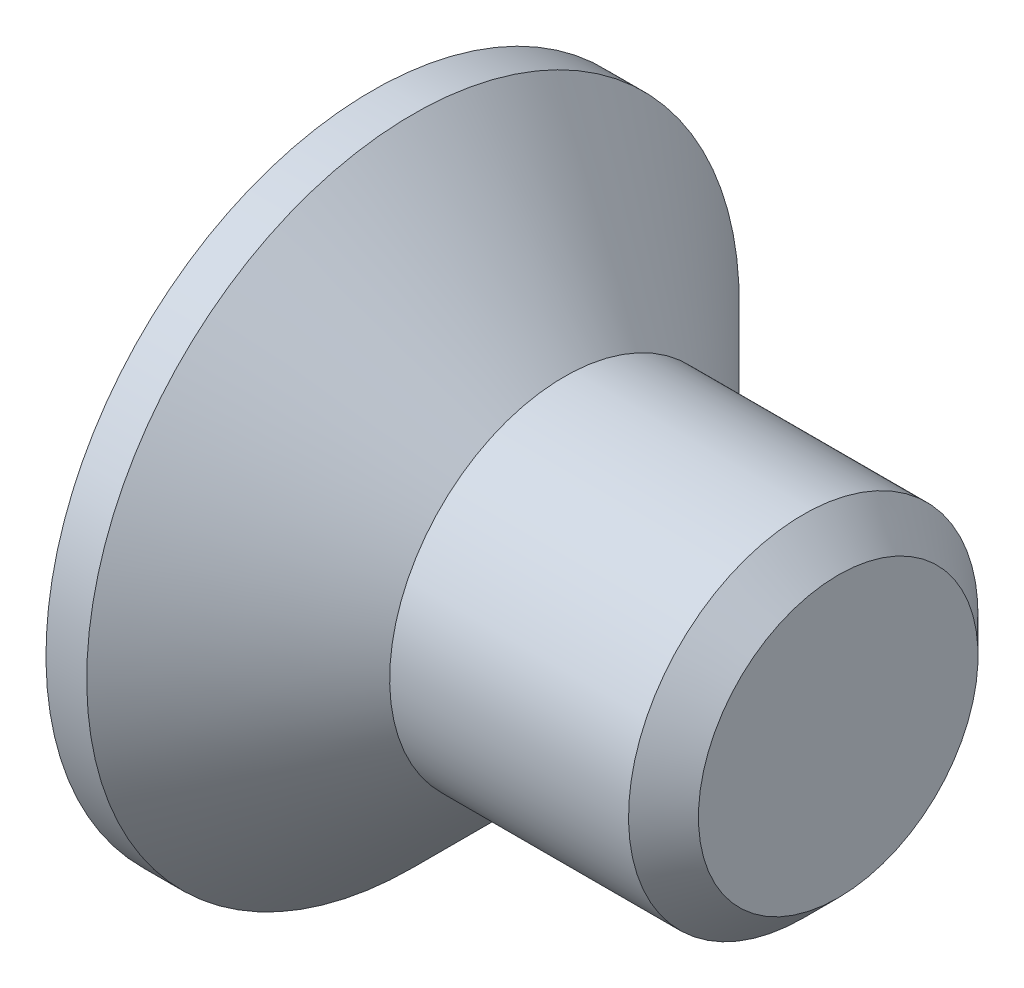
ISO-10303-21;
HEADER;
FILE_DESCRIPTION(('STEP AP214'),'2;1');
FILE_NAME('part.step','',(''),(''),'','','');
FILE_SCHEMA(('AUTOMOTIVE_DESIGN { 1 0 10303 214 1 1 1 1 }'));
ENDSEC;
DATA;
#1=APPLICATION_CONTEXT('core data for automotive mechanical design processes');
#2=APPLICATION_PROTOCOL_DEFINITION('international standard','automotive_design',2000,#1);
#3=PRODUCT_CONTEXT('',#1,'mechanical');
#4=PRODUCT('Part','Part','',(#3));
#5=PRODUCT_RELATED_PRODUCT_CATEGORY('part','',(#4));
#6=PRODUCT_DEFINITION_FORMATION('','',#4);
#7=PRODUCT_DEFINITION_CONTEXT('part definition',#1,'design');
#8=PRODUCT_DEFINITION('design','',#6,#7);
#9=PRODUCT_DEFINITION_SHAPE('','',#8);
#10=(LENGTH_UNIT() NAMED_UNIT(*) SI_UNIT(.MILLI.,.METRE.));
#11=(NAMED_UNIT(*) PLANE_ANGLE_UNIT() SI_UNIT($,.RADIAN.));
#12=(NAMED_UNIT(*) SI_UNIT($,.STERADIAN.) SOLID_ANGLE_UNIT());
#13=UNCERTAINTY_MEASURE_WITH_UNIT(LENGTH_MEASURE(1.E-05),#10,'distance_accuracy_value','');
#14=(GEOMETRIC_REPRESENTATION_CONTEXT(3) GLOBAL_UNCERTAINTY_ASSIGNED_CONTEXT((#13)) GLOBAL_UNIT_ASSIGNED_CONTEXT((#10,
#11,#12)) REPRESENTATION_CONTEXT('',''));
#15=CARTESIAN_POINT('',(0.,0.,0.));
#16=DIRECTION('',(0.,0.,1.));
#17=DIRECTION('',(1.,0.,0.));
#18=AXIS2_PLACEMENT_3D('',#15,#16,#17);
#19=CARTESIAN_POINT('',(0.,0.,0.));
#20=DIRECTION('',(-1.,0.,0.));
#21=DIRECTION('',(0.,-1.,0.));
#22=AXIS2_PLACEMENT_3D('',#19,#20,#21);
#23=CONICAL_SURFACE('',#22,1.5,0.78539816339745);
#24=CARTESIAN_POINT('',(-1.3,0.,0.));
#25=DIRECTION('',(-1.,0.,0.));
#26=DIRECTION('',(0.,-1.,0.));
#27=AXIS2_PLACEMENT_3D('',#24,#25,#26);
#28=CIRCLE('',#27,2.8);
#29=CARTESIAN_POINT('',(-1.3,-2.8,0.));
#30=VERTEX_POINT('',#29);
#31=EDGE_CURVE('E189',#30,#30,#28,.T.);
#32=ORIENTED_EDGE('',*,*,#31,.F.);
#33=EDGE_LOOP('',(#32));
#34=FACE_BOUND('',#33,.T.);
#35=CARTESIAN_POINT('',(0.,0.,0.));
#36=DIRECTION('',(-1.,0.,0.));
#37=DIRECTION('',(0.,-1.,0.));
#38=AXIS2_PLACEMENT_3D('',#35,#36,#37);
#39=CIRCLE('',#38,1.5);
#40=CARTESIAN_POINT('',(0.,-1.5,0.));
#41=VERTEX_POINT('',#40);
#42=EDGE_CURVE('E212',#41,#41,#39,.T.);
#43=ORIENTED_EDGE('',*,*,#42,.T.);
#44=EDGE_LOOP('',(#43));
#45=FACE_BOUND('',#44,.T.);
#46=ADVANCED_FACE('F33',(#34,#45),#23,.T.);
#47=CARTESIAN_POINT('',(-1.65,0.,0.));
#48=DIRECTION('',(-1.,0.,0.));
#49=DIRECTION('',(0.,-1.,0.));
#50=AXIS2_PLACEMENT_3D('',#47,#48,#49);
#51=CYLINDRICAL_SURFACE('',#50,1.5);
#52=CARTESIAN_POINT('',(2.05,0.,0.));
#53=DIRECTION('',(-1.,0.,0.));
#54=DIRECTION('',(0.,-1.,0.));
#55=AXIS2_PLACEMENT_3D('',#52,#53,#54);
#56=CIRCLE('',#55,1.5);
#57=CARTESIAN_POINT('',(2.05,-1.5,0.));
#58=VERTEX_POINT('',#57);
#59=EDGE_CURVE('E41',#58,#58,#56,.T.);
#60=ORIENTED_EDGE('',*,*,#59,.T.);
#61=EDGE_LOOP('',(#60));
#62=FACE_BOUND('',#61,.T.);
#63=ORIENTED_EDGE('',*,*,#42,.F.);
#64=EDGE_LOOP('',(#63));
#65=FACE_BOUND('',#64,.T.);
#66=ADVANCED_FACE('F217',(#62,#65),#51,.T.);
#67=CARTESIAN_POINT('',(2.35,0.,0.));
#68=DIRECTION('',(-1.,0.,0.));
#69=DIRECTION('',(0.,-1.,0.));
#70=AXIS2_PLACEMENT_3D('',#67,#68,#69);
#71=PLANE('',#70);
#72=CARTESIAN_POINT('',(2.35,0.,0.));
#73=DIRECTION('',(-1.,0.,0.));
#74=DIRECTION('',(0.,-1.,0.));
#75=AXIS2_PLACEMENT_3D('',#72,#73,#74);
#76=CIRCLE('',#75,1.2);
#77=CARTESIAN_POINT('',(2.35,-1.2,0.));
#78=VERTEX_POINT('',#77);
#79=EDGE_CURVE('E11',#78,#78,#76,.F.);
#80=ORIENTED_EDGE('',*,*,#79,.T.);
#81=EDGE_LOOP('',(#80));
#82=FACE_BOUND('',#81,.T.);
#83=ADVANCED_FACE('F239',(#82),#71,.F.);
#84=CARTESIAN_POINT('',(-1.65,2.8,0.));
#85=DIRECTION('',(1.,0.,0.));
#86=DIRECTION('',(0.,1.,0.));
#87=AXIS2_PLACEMENT_3D('',#84,#85,#86);
#88=PLANE('',#87);
#89=DIRECTION('',(0.,0.,-1.));
#90=VECTOR('',#89,1.);
#91=CARTESIAN_POINT('',(-1.65,0.365,-1.45));
#92=LINE('',#91,#90);
#93=CARTESIAN_POINT('',(-1.65,0.365,-0.365));
#94=VERTEX_POINT('',#93);
#95=CARTESIAN_POINT('',(-1.65,0.365,-1.45));
#96=VERTEX_POINT('',#95);
#97=EDGE_CURVE('E158',#94,#96,#92,.T.);
#98=ORIENTED_EDGE('',*,*,#97,.F.);
#99=DIRECTION('',(0.,-1.,0.));
#100=VECTOR('',#99,1.);
#101=CARTESIAN_POINT('',(-1.65,0.365,-0.365));
#102=LINE('',#101,#100);
#103=CARTESIAN_POINT('',(-1.65,1.45,-0.365));
#104=VERTEX_POINT('',#103);
#105=EDGE_CURVE('E48',#104,#94,#102,.T.);
#106=ORIENTED_EDGE('',*,*,#105,.F.);
#107=DIRECTION('',(0.,0.,-1.));
#108=VECTOR('',#107,1.);
#109=CARTESIAN_POINT('',(-1.65,1.45,-0.365));
#110=LINE('',#109,#108);
#111=CARTESIAN_POINT('',(-1.65,1.45,0.365));
#112=VERTEX_POINT('',#111);
#113=EDGE_CURVE('E185',#112,#104,#110,.T.);
#114=ORIENTED_EDGE('',*,*,#113,.F.);
#115=DIRECTION('',(0.,1.,0.));
#116=VECTOR('',#115,1.);
#117=CARTESIAN_POINT('',(-1.65,1.45,0.365));
#118=LINE('',#117,#116);
#119=CARTESIAN_POINT('',(-1.65,0.365,0.365));
#120=VERTEX_POINT('',#119);
#121=EDGE_CURVE('E183',#120,#112,#118,.T.);
#122=ORIENTED_EDGE('',*,*,#121,.F.);
#123=DIRECTION('',(0.,0.,-1.));
#124=VECTOR('',#123,1.);
#125=CARTESIAN_POINT('',(-1.65,0.365,0.365));
#126=LINE('',#125,#124);
#127=CARTESIAN_POINT('',(-1.65,0.365,1.45));
#128=VERTEX_POINT('',#127);
#129=EDGE_CURVE('E132',#128,#120,#126,.T.);
#130=ORIENTED_EDGE('',*,*,#129,.F.);
#131=DIRECTION('',(0.,1.,0.));
#132=VECTOR('',#131,1.);
#133=CARTESIAN_POINT('',(-1.65,0.365,1.45));
#134=LINE('',#133,#132);
#135=CARTESIAN_POINT('',(-1.65,-0.365,1.45));
#136=VERTEX_POINT('',#135);
#137=EDGE_CURVE('E179',#136,#128,#134,.T.);
#138=ORIENTED_EDGE('',*,*,#137,.F.);
#139=DIRECTION('',(0.,0.,1.));
#140=VECTOR('',#139,1.);
#141=CARTESIAN_POINT('',(-1.65,-0.365,1.45));
#142=LINE('',#141,#140);
#143=CARTESIAN_POINT('',(-1.65,-0.365,0.365));
#144=VERTEX_POINT('',#143);
#145=EDGE_CURVE('E176',#144,#136,#142,.T.);
#146=ORIENTED_EDGE('',*,*,#145,.F.);
#147=DIRECTION('',(0.,1.,0.));
#148=VECTOR('',#147,1.);
#149=CARTESIAN_POINT('',(-1.65,-0.365,0.365));
#150=LINE('',#149,#148);
#151=CARTESIAN_POINT('',(-1.65,-1.45,0.365));
#152=VERTEX_POINT('',#151);
#153=EDGE_CURVE('E173',#152,#144,#150,.T.);
#154=ORIENTED_EDGE('',*,*,#153,.F.);
#155=DIRECTION('',(0.,0.,1.));
#156=VECTOR('',#155,1.);
#157=CARTESIAN_POINT('',(-1.65,-1.45,0.365));
#158=LINE('',#157,#156);
#159=CARTESIAN_POINT('',(-1.65,-1.45,-0.365));
#160=VERTEX_POINT('',#159);
#161=EDGE_CURVE('E170',#160,#152,#158,.T.);
#162=ORIENTED_EDGE('',*,*,#161,.F.);
#163=DIRECTION('',(0.,-1.,0.));
#164=VECTOR('',#163,1.);
#165=CARTESIAN_POINT('',(-1.65,-1.45,-0.365));
#166=LINE('',#165,#164);
#167=CARTESIAN_POINT('',(-1.65,-0.365,-0.365));
#168=VERTEX_POINT('',#167);
#169=EDGE_CURVE('E167',#168,#160,#166,.T.);
#170=ORIENTED_EDGE('',*,*,#169,.F.);
#171=DIRECTION('',(0.,0.,1.));
#172=VECTOR('',#171,1.);
#173=CARTESIAN_POINT('',(-1.65,-0.365,-0.365));
#174=LINE('',#173,#172);
#175=CARTESIAN_POINT('',(-1.65,-0.365,-1.45));
#176=VERTEX_POINT('',#175);
#177=EDGE_CURVE('E164',#176,#168,#174,.T.);
#178=ORIENTED_EDGE('',*,*,#177,.F.);
#179=DIRECTION('',(0.,-1.,0.));
#180=VECTOR('',#179,1.);
#181=CARTESIAN_POINT('',(-1.65,-0.365,-1.45));
#182=LINE('',#181,#180);
#183=EDGE_CURVE('E161',#96,#176,#182,.T.);
#184=ORIENTED_EDGE('',*,*,#183,.F.);
#185=EDGE_LOOP('',(#98,#106,#114,#122,#130,#138,#146,#154,#162,#170,#178,#184));
#186=FACE_BOUND('',#185,.T.);
#187=CARTESIAN_POINT('',(-1.65,0.,0.));
#188=DIRECTION('',(-1.,0.,0.));
#189=DIRECTION('',(0.,-1.,0.));
#190=AXIS2_PLACEMENT_3D('',#187,#188,#189);
#191=CIRCLE('',#190,2.8);
#192=CARTESIAN_POINT('',(-1.65,-2.8,0.));
#193=VERTEX_POINT('',#192);
#194=EDGE_CURVE('E209',#193,#193,#191,.T.);
#195=ORIENTED_EDGE('',*,*,#194,.T.);
#196=EDGE_LOOP('',(#195));
#197=FACE_BOUND('',#196,.T.);
#198=ADVANCED_FACE('F230',(#186,#197),#88,.F.);
#199=CARTESIAN_POINT('',(-1.65,0.,0.));
#200=DIRECTION('',(-1.,0.,0.));
#201=DIRECTION('',(0.,-1.,0.));
#202=AXIS2_PLACEMENT_3D('',#199,#200,#201);
#203=CYLINDRICAL_SURFACE('',#202,2.8);
#204=ORIENTED_EDGE('',*,*,#194,.F.);
#205=EDGE_LOOP('',(#204));
#206=FACE_BOUND('',#205,.T.);
#207=ORIENTED_EDGE('',*,*,#31,.T.);
#208=EDGE_LOOP('',(#207));
#209=FACE_BOUND('',#208,.T.);
#210=ADVANCED_FACE('F222',(#206,#209),#203,.T.);
#211=CARTESIAN_POINT('',(2.05,0.,0.));
#212=DIRECTION('',(-1.,0.,0.));
#213=DIRECTION('',(0.,-1.,0.));
#214=AXIS2_PLACEMENT_3D('',#211,#212,#213);
#215=CONICAL_SURFACE('',#214,1.5,0.78539816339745);
#216=ORIENTED_EDGE('',*,*,#79,.F.);
#217=EDGE_LOOP('',(#216));
#218=FACE_BOUND('',#217,.T.);
#219=ORIENTED_EDGE('',*,*,#59,.F.);
#220=EDGE_LOOP('',(#219));
#221=FACE_BOUND('',#220,.T.);
#222=ADVANCED_FACE('F35',(#218,#221),#215,.T.);
#223=CARTESIAN_POINT('',(-0.4,0.365,-0.365));
#224=DIRECTION('',(0.,0.,-1.));
#225=DIRECTION('',(-1.,0.,0.));
#226=AXIS2_PLACEMENT_3D('',#223,#224,#225);
#227=PLANE('',#226);
#228=ORIENTED_EDGE('',*,*,#105,.T.);
#229=DIRECTION('',(-1.,0.,0.));
#230=VECTOR('',#229,1.);
#231=CARTESIAN_POINT('',(-0.4,0.365,-0.365));
#232=LINE('',#231,#230);
#233=CARTESIAN_POINT('',(-0.4,0.365,-0.365));
#234=VERTEX_POINT('',#233);
#235=EDGE_CURVE('E96',#234,#94,#232,.T.);
#236=ORIENTED_EDGE('',*,*,#235,.F.);
#237=DIRECTION('',(0.,-1.,0.));
#238=VECTOR('',#237,1.);
#239=CARTESIAN_POINT('',(-0.4,0.365,-0.365));
#240=LINE('',#239,#238);
#241=CARTESIAN_POINT('',(-0.4,1.45,-0.365));
#242=VERTEX_POINT('',#241);
#243=EDGE_CURVE('E187',#242,#234,#240,.T.);
#244=ORIENTED_EDGE('',*,*,#243,.F.);
#245=DIRECTION('',(-1.,0.,0.));
#246=VECTOR('',#245,1.);
#247=CARTESIAN_POINT('',(-0.4,1.45,-0.365));
#248=LINE('',#247,#246);
#249=EDGE_CURVE('E56',#242,#104,#248,.T.);
#250=ORIENTED_EDGE('',*,*,#249,.T.);
#251=EDGE_LOOP('',(#228,#236,#244,#250));
#252=FACE_BOUND('',#251,.T.);
#253=ADVANCED_FACE('F221',(#252),#227,.F.);
#254=CARTESIAN_POINT('',(-0.4,1.45,-0.365));
#255=DIRECTION('',(0.,1.,0.));
#256=DIRECTION('',(-1.,0.,0.));
#257=AXIS2_PLACEMENT_3D('',#254,#255,#256);
#258=PLANE('',#257);
#259=ORIENTED_EDGE('',*,*,#113,.T.);
#260=ORIENTED_EDGE('',*,*,#249,.F.);
#261=DIRECTION('',(0.,0.,-1.));
#262=VECTOR('',#261,1.);
#263=CARTESIAN_POINT('',(-0.4,1.45,-0.365));
#264=LINE('',#263,#262);
#265=CARTESIAN_POINT('',(-0.4,1.45,0.365));
#266=VERTEX_POINT('',#265);
#267=EDGE_CURVE('E144',#266,#242,#264,.T.);
#268=ORIENTED_EDGE('',*,*,#267,.F.);
#269=DIRECTION('',(-1.,0.,0.));
#270=VECTOR('',#269,1.);
#271=CARTESIAN_POINT('',(-0.4,1.45,0.365));
#272=LINE('',#271,#270);
#273=EDGE_CURVE('E136',#266,#112,#272,.T.);
#274=ORIENTED_EDGE('',*,*,#273,.T.);
#275=EDGE_LOOP('',(#259,#260,#268,#274));
#276=FACE_BOUND('',#275,.T.);
#277=ADVANCED_FACE('F228',(#276),#258,.F.);
#278=CARTESIAN_POINT('',(-0.4,1.45,0.365));
#279=DIRECTION('',(0.,0.,1.));
#280=DIRECTION('',(1.,0.,0.));
#281=AXIS2_PLACEMENT_3D('',#278,#279,#280);
#282=PLANE('',#281);
#283=ORIENTED_EDGE('',*,*,#121,.T.);
#284=ORIENTED_EDGE('',*,*,#273,.F.);
#285=DIRECTION('',(0.,1.,0.));
#286=VECTOR('',#285,1.);
#287=CARTESIAN_POINT('',(-0.4,1.45,0.365));
#288=LINE('',#287,#286);
#289=CARTESIAN_POINT('',(-0.4,0.365,0.365));
#290=VERTEX_POINT('',#289);
#291=EDGE_CURVE('E140',#290,#266,#288,.T.);
#292=ORIENTED_EDGE('',*,*,#291,.F.);
#293=DIRECTION('',(-1.,0.,0.));
#294=VECTOR('',#293,1.);
#295=CARTESIAN_POINT('',(-0.4,0.365,0.365));
#296=LINE('',#295,#294);
#297=EDGE_CURVE('E125',#290,#120,#296,.T.);
#298=ORIENTED_EDGE('',*,*,#297,.T.);
#299=EDGE_LOOP('',(#283,#284,#292,#298));
#300=FACE_BOUND('',#299,.T.);
#301=ADVANCED_FACE('F141',(#300),#282,.F.);
#302=CARTESIAN_POINT('',(-0.4,0.365,0.365));
#303=DIRECTION('',(0.,1.,0.));
#304=DIRECTION('',(-1.,0.,0.));
#305=AXIS2_PLACEMENT_3D('',#302,#303,#304);
#306=PLANE('',#305);
#307=ORIENTED_EDGE('',*,*,#129,.T.);
#308=ORIENTED_EDGE('',*,*,#297,.F.);
#309=DIRECTION('',(0.,0.,-1.));
#310=VECTOR('',#309,1.);
#311=CARTESIAN_POINT('',(-0.4,0.365,0.365));
#312=LINE('',#311,#310);
#313=CARTESIAN_POINT('',(-0.4,0.365,1.45));
#314=VERTEX_POINT('',#313);
#315=EDGE_CURVE('E129',#314,#290,#312,.T.);
#316=ORIENTED_EDGE('',*,*,#315,.F.);
#317=DIRECTION('',(-1.,0.,0.));
#318=VECTOR('',#317,1.);
#319=CARTESIAN_POINT('',(-0.4,0.365,1.45));
#320=LINE('',#319,#318);
#321=EDGE_CURVE('E137',#314,#128,#320,.T.);
#322=ORIENTED_EDGE('',*,*,#321,.T.);
#323=EDGE_LOOP('',(#307,#308,#316,#322));
#324=FACE_BOUND('',#323,.T.);
#325=ADVANCED_FACE('F127',(#324),#306,.F.);
#326=CARTESIAN_POINT('',(-0.4,0.365,1.45));
#327=DIRECTION('',(0.,0.,1.));
#328=DIRECTION('',(1.,0.,0.));
#329=AXIS2_PLACEMENT_3D('',#326,#327,#328);
#330=PLANE('',#329);
#331=ORIENTED_EDGE('',*,*,#137,.T.);
#332=ORIENTED_EDGE('',*,*,#321,.F.);
#333=DIRECTION('',(0.,1.,0.));
#334=VECTOR('',#333,1.);
#335=CARTESIAN_POINT('',(-0.4,0.365,1.45));
#336=LINE('',#335,#334);
#337=CARTESIAN_POINT('',(-0.4,-0.365,1.45));
#338=VERTEX_POINT('',#337);
#339=EDGE_CURVE('E150',#338,#314,#336,.T.);
#340=ORIENTED_EDGE('',*,*,#339,.F.);
#341=DIRECTION('',(-1.,0.,0.));
#342=VECTOR('',#341,1.);
#343=CARTESIAN_POINT('',(-0.4,-0.365,1.45));
#344=LINE('',#343,#342);
#345=EDGE_CURVE('E192',#338,#136,#344,.T.);
#346=ORIENTED_EDGE('',*,*,#345,.T.);
#347=EDGE_LOOP('',(#331,#332,#340,#346));
#348=FACE_BOUND('',#347,.T.);
#349=ADVANCED_FACE('F277',(#348),#330,.F.);
#350=CARTESIAN_POINT('',(-0.4,-0.365,1.45));
#351=DIRECTION('',(0.,-1.,0.));
#352=DIRECTION('',(1.,0.,0.));
#353=AXIS2_PLACEMENT_3D('',#350,#351,#352);
#354=PLANE('',#353);
#355=ORIENTED_EDGE('',*,*,#145,.T.);
#356=ORIENTED_EDGE('',*,*,#345,.F.);
#357=DIRECTION('',(0.,0.,1.));
#358=VECTOR('',#357,1.);
#359=CARTESIAN_POINT('',(-0.4,-0.365,1.45));
#360=LINE('',#359,#358);
#361=CARTESIAN_POINT('',(-0.4,-0.365,0.365));
#362=VERTEX_POINT('',#361);
#363=EDGE_CURVE('E152',#362,#338,#360,.T.);
#364=ORIENTED_EDGE('',*,*,#363,.F.);
#365=DIRECTION('',(-1.,0.,0.));
#366=VECTOR('',#365,1.);
#367=CARTESIAN_POINT('',(-0.4,-0.365,0.365));
#368=LINE('',#367,#366);
#369=EDGE_CURVE('E194',#362,#144,#368,.T.);
#370=ORIENTED_EDGE('',*,*,#369,.T.);
#371=EDGE_LOOP('',(#355,#356,#364,#370));
#372=FACE_BOUND('',#371,.T.);
#373=ADVANCED_FACE('F273',(#372),#354,.F.);
#374=CARTESIAN_POINT('',(-0.4,-0.365,0.365));
#375=DIRECTION('',(0.,0.,1.));
#376=DIRECTION('',(1.,0.,0.));
#377=AXIS2_PLACEMENT_3D('',#374,#375,#376);
#378=PLANE('',#377);
#379=ORIENTED_EDGE('',*,*,#153,.T.);
#380=ORIENTED_EDGE('',*,*,#369,.F.);
#381=DIRECTION('',(0.,1.,0.));
#382=VECTOR('',#381,1.);
#383=CARTESIAN_POINT('',(-0.4,-0.365,0.365));
#384=LINE('',#383,#382);
#385=CARTESIAN_POINT('',(-0.4,-1.45,0.365));
#386=VERTEX_POINT('',#385);
#387=EDGE_CURVE('E422',#386,#362,#384,.T.);
#388=ORIENTED_EDGE('',*,*,#387,.F.);
#389=DIRECTION('',(-1.,0.,0.));
#390=VECTOR('',#389,1.);
#391=CARTESIAN_POINT('',(-0.4,-1.45,0.365));
#392=LINE('',#391,#390);
#393=EDGE_CURVE('E196',#386,#152,#392,.T.);
#394=ORIENTED_EDGE('',*,*,#393,.T.);
#395=EDGE_LOOP('',(#379,#380,#388,#394));
#396=FACE_BOUND('',#395,.T.);
#397=ADVANCED_FACE('F269',(#396),#378,.F.);
#398=CARTESIAN_POINT('',(-0.4,-1.45,0.365));
#399=DIRECTION('',(0.,-1.,0.));
#400=DIRECTION('',(1.,0.,0.));
#401=AXIS2_PLACEMENT_3D('',#398,#399,#400);
#402=PLANE('',#401);
#403=ORIENTED_EDGE('',*,*,#161,.T.);
#404=ORIENTED_EDGE('',*,*,#393,.F.);
#405=DIRECTION('',(0.,0.,1.));
#406=VECTOR('',#405,1.);
#407=CARTESIAN_POINT('',(-0.4,-1.45,0.365));
#408=LINE('',#407,#406);
#409=CARTESIAN_POINT('',(-0.4,-1.45,-0.365));
#410=VERTEX_POINT('',#409);
#411=EDGE_CURVE('E419',#410,#386,#408,.T.);
#412=ORIENTED_EDGE('',*,*,#411,.F.);
#413=DIRECTION('',(-1.,0.,0.));
#414=VECTOR('',#413,1.);
#415=CARTESIAN_POINT('',(-0.4,-1.45,-0.365));
#416=LINE('',#415,#414);
#417=EDGE_CURVE('E198',#410,#160,#416,.T.);
#418=ORIENTED_EDGE('',*,*,#417,.T.);
#419=EDGE_LOOP('',(#403,#404,#412,#418));
#420=FACE_BOUND('',#419,.T.);
#421=ADVANCED_FACE('F265',(#420),#402,.F.);
#422=CARTESIAN_POINT('',(-0.4,-1.45,-0.365));
#423=DIRECTION('',(0.,0.,-1.));
#424=DIRECTION('',(-1.,0.,0.));
#425=AXIS2_PLACEMENT_3D('',#422,#423,#424);
#426=PLANE('',#425);
#427=ORIENTED_EDGE('',*,*,#169,.T.);
#428=ORIENTED_EDGE('',*,*,#417,.F.);
#429=DIRECTION('',(0.,-1.,0.));
#430=VECTOR('',#429,1.);
#431=CARTESIAN_POINT('',(-0.4,-1.45,-0.365));
#432=LINE('',#431,#430);
#433=CARTESIAN_POINT('',(-0.4,-0.365,-0.365));
#434=VERTEX_POINT('',#433);
#435=EDGE_CURVE('E416',#434,#410,#432,.T.);
#436=ORIENTED_EDGE('',*,*,#435,.F.);
#437=DIRECTION('',(-1.,0.,0.));
#438=VECTOR('',#437,1.);
#439=CARTESIAN_POINT('',(-0.4,-0.365,-0.365));
#440=LINE('',#439,#438);
#441=EDGE_CURVE('E200',#434,#168,#440,.T.);
#442=ORIENTED_EDGE('',*,*,#441,.T.);
#443=EDGE_LOOP('',(#427,#428,#436,#442));
#444=FACE_BOUND('',#443,.T.);
#445=ADVANCED_FACE('F261',(#444),#426,.F.);
#446=CARTESIAN_POINT('',(-0.4,-0.365,-0.365));
#447=DIRECTION('',(0.,-1.,0.));
#448=DIRECTION('',(1.,0.,0.));
#449=AXIS2_PLACEMENT_3D('',#446,#447,#448);
#450=PLANE('',#449);
#451=ORIENTED_EDGE('',*,*,#177,.T.);
#452=ORIENTED_EDGE('',*,*,#441,.F.);
#453=DIRECTION('',(0.,0.,1.));
#454=VECTOR('',#453,1.);
#455=CARTESIAN_POINT('',(-0.4,-0.365,-0.365));
#456=LINE('',#455,#454);
#457=CARTESIAN_POINT('',(-0.4,-0.365,-1.45));
#458=VERTEX_POINT('',#457);
#459=EDGE_CURVE('E413',#458,#434,#456,.T.);
#460=ORIENTED_EDGE('',*,*,#459,.F.);
#461=DIRECTION('',(-1.,0.,0.));
#462=VECTOR('',#461,1.);
#463=CARTESIAN_POINT('',(-0.4,-0.365,-1.45));
#464=LINE('',#463,#462);
#465=EDGE_CURVE('E202',#458,#176,#464,.T.);
#466=ORIENTED_EDGE('',*,*,#465,.T.);
#467=EDGE_LOOP('',(#451,#452,#460,#466));
#468=FACE_BOUND('',#467,.T.);
#469=ADVANCED_FACE('F257',(#468),#450,.F.);
#470=CARTESIAN_POINT('',(-0.4,-0.365,-1.45));
#471=DIRECTION('',(0.,0.,-1.));
#472=DIRECTION('',(-1.,0.,0.));
#473=AXIS2_PLACEMENT_3D('',#470,#471,#472);
#474=PLANE('',#473);
#475=ORIENTED_EDGE('',*,*,#183,.T.);
#476=ORIENTED_EDGE('',*,*,#465,.F.);
#477=DIRECTION('',(0.,-1.,0.));
#478=VECTOR('',#477,1.);
#479=CARTESIAN_POINT('',(-0.4,-0.365,-1.45));
#480=LINE('',#479,#478);
#481=CARTESIAN_POINT('',(-0.4,0.365,-1.45));
#482=VERTEX_POINT('',#481);
#483=EDGE_CURVE('E408',#482,#458,#480,.T.);
#484=ORIENTED_EDGE('',*,*,#483,.F.);
#485=DIRECTION('',(-1.,0.,0.));
#486=VECTOR('',#485,1.);
#487=CARTESIAN_POINT('',(-0.4,0.365,-1.45));
#488=LINE('',#487,#486);
#489=EDGE_CURVE('E204',#482,#96,#488,.T.);
#490=ORIENTED_EDGE('',*,*,#489,.T.);
#491=EDGE_LOOP('',(#475,#476,#484,#490));
#492=FACE_BOUND('',#491,.T.);
#493=ADVANCED_FACE('F253',(#492),#474,.F.);
#494=CARTESIAN_POINT('',(-0.4,0.365,-1.45));
#495=DIRECTION('',(0.,1.,0.));
#496=DIRECTION('',(-1.,0.,0.));
#497=AXIS2_PLACEMENT_3D('',#494,#495,#496);
#498=PLANE('',#497);
#499=ORIENTED_EDGE('',*,*,#97,.T.);
#500=ORIENTED_EDGE('',*,*,#489,.F.);
#501=DIRECTION('',(0.,0.,-1.));
#502=VECTOR('',#501,1.);
#503=CARTESIAN_POINT('',(-0.4,0.365,-1.45));
#504=LINE('',#503,#502);
#505=EDGE_CURVE('E406',#234,#482,#504,.T.);
#506=ORIENTED_EDGE('',*,*,#505,.F.);
#507=ORIENTED_EDGE('',*,*,#235,.T.);
#508=EDGE_LOOP('',(#499,#500,#506,#507));
#509=FACE_BOUND('',#508,.T.);
#510=ADVANCED_FACE('F250',(#509),#498,.F.);
#511=CARTESIAN_POINT('',(-0.4,0.,0.));
#512=DIRECTION('',(1.,0.,0.));
#513=DIRECTION('',(0.,0.,-1.));
#514=AXIS2_PLACEMENT_3D('',#511,#512,#513);
#515=PLANE('',#514);
#516=ORIENTED_EDGE('',*,*,#243,.T.);
#517=ORIENTED_EDGE('',*,*,#505,.T.);
#518=ORIENTED_EDGE('',*,*,#483,.T.);
#519=ORIENTED_EDGE('',*,*,#459,.T.);
#520=ORIENTED_EDGE('',*,*,#435,.T.);
#521=ORIENTED_EDGE('',*,*,#411,.T.);
#522=ORIENTED_EDGE('',*,*,#387,.T.);
#523=ORIENTED_EDGE('',*,*,#363,.T.);
#524=ORIENTED_EDGE('',*,*,#339,.T.);
#525=ORIENTED_EDGE('',*,*,#315,.T.);
#526=ORIENTED_EDGE('',*,*,#291,.T.);
#527=ORIENTED_EDGE('',*,*,#267,.T.);
#528=EDGE_LOOP('',(#516,#517,#518,#519,#520,#521,#522,#523,#524,#525,#526,#527));
#529=FACE_BOUND('',#528,.T.);
#530=ADVANCED_FACE('F147',(#529),#515,.F.);
#531=CLOSED_SHELL('',(#46,#66,#83,#198,#210,#222,#253,#277,#301,#325,#349,#373,#397,#421,#445,
#469,#493,#510,#530));
#532=MANIFOLD_SOLID_BREP('B2',#531);
#533=ADVANCED_BREP_SHAPE_REPRESENTATION('',(#18,#532),#14);
#534=SHAPE_DEFINITION_REPRESENTATION(#9,#533);
ENDSEC;
END-ISO-10303-21;
